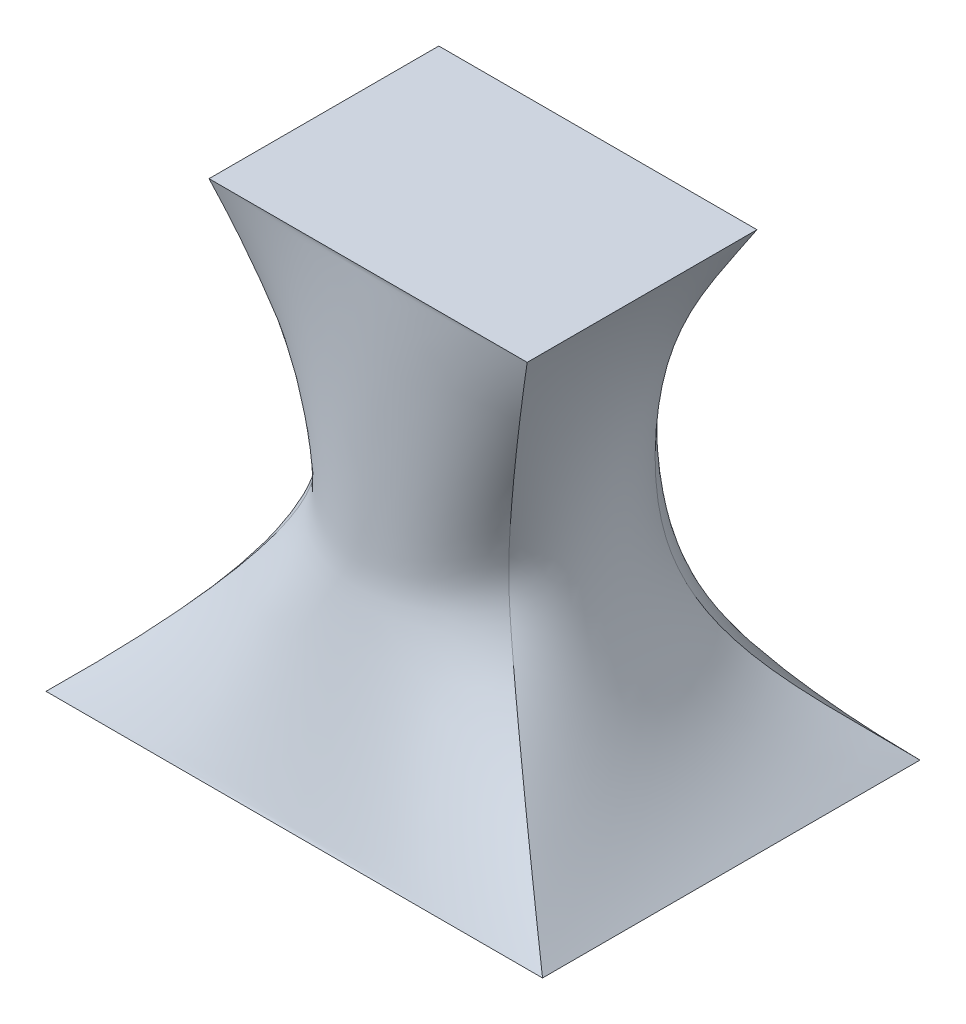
ISO-10303-21;
HEADER;
FILE_DESCRIPTION(('STEP AP214'),'2;1');
FILE_NAME('part.step','',(''),(''),'','','');
FILE_SCHEMA(('AUTOMOTIVE_DESIGN { 1 0 10303 214 1 1 1 1 }'));
ENDSEC;
DATA;
#1=APPLICATION_CONTEXT('core data for automotive mechanical design processes');
#2=APPLICATION_PROTOCOL_DEFINITION('international standard','automotive_design',2000,#1);
#3=PRODUCT_CONTEXT('',#1,'mechanical');
#4=PRODUCT('Part','Part','',(#3));
#5=PRODUCT_RELATED_PRODUCT_CATEGORY('part','',(#4));
#6=PRODUCT_DEFINITION_FORMATION('','',#4);
#7=PRODUCT_DEFINITION_CONTEXT('part definition',#1,'design');
#8=PRODUCT_DEFINITION('design','',#6,#7);
#9=PRODUCT_DEFINITION_SHAPE('','',#8);
#10=(LENGTH_UNIT() NAMED_UNIT(*) SI_UNIT(.MILLI.,.METRE.));
#11=(NAMED_UNIT(*) PLANE_ANGLE_UNIT() SI_UNIT($,.RADIAN.));
#12=(NAMED_UNIT(*) SI_UNIT($,.STERADIAN.) SOLID_ANGLE_UNIT());
#13=UNCERTAINTY_MEASURE_WITH_UNIT(LENGTH_MEASURE(1.E-05),#10,'distance_accuracy_value','');
#14=(GEOMETRIC_REPRESENTATION_CONTEXT(3) GLOBAL_UNCERTAINTY_ASSIGNED_CONTEXT((#13)) GLOBAL_UNIT_ASSIGNED_CONTEXT((#10,
#11,#12)) REPRESENTATION_CONTEXT('',''));
#15=CARTESIAN_POINT('',(0.,0.,0.));
#16=DIRECTION('',(0.,0.,1.));
#17=DIRECTION('',(1.,0.,0.));
#18=AXIS2_PLACEMENT_3D('',#15,#16,#17);
#19=CARTESIAN_POINT('',(0.,89.15,0.));
#20=DIRECTION('',(0.,1.,0.));
#21=DIRECTION('',(0.,0.,1.));
#22=AXIS2_PLACEMENT_3D('',#19,#20,#21);
#23=PLANE('',#22);
#24=DIRECTION('',(0.,0.,-1.));
#25=VECTOR('',#24,1.);
#26=CARTESIAN_POINT('',(31.4,89.15,22.675));
#27=LINE('',#26,#25);
#28=CARTESIAN_POINT('',(31.4,89.15,22.675));
#29=VERTEX_POINT('',#28);
#30=CARTESIAN_POINT('',(31.4,89.15,-22.675));
#31=VERTEX_POINT('',#30);
#32=EDGE_CURVE('E251',#29,#31,#27,.T.);
#33=ORIENTED_EDGE('',*,*,#32,.T.);
#34=DIRECTION('',(-1.,0.,0.));
#35=VECTOR('',#34,1.);
#36=CARTESIAN_POINT('',(31.4,89.15,-22.675));
#37=LINE('',#36,#35);
#38=CARTESIAN_POINT('',(-31.4,89.15,-22.675));
#39=VERTEX_POINT('',#38);
#40=EDGE_CURVE('E307',#31,#39,#37,.T.);
#41=ORIENTED_EDGE('',*,*,#40,.T.);
#42=DIRECTION('',(0.,0.,1.));
#43=VECTOR('',#42,1.);
#44=CARTESIAN_POINT('',(-31.4,89.15,22.675));
#45=LINE('',#44,#43);
#46=CARTESIAN_POINT('',(-31.4,89.15,22.675));
#47=VERTEX_POINT('',#46);
#48=EDGE_CURVE('E106',#39,#47,#45,.T.);
#49=ORIENTED_EDGE('',*,*,#48,.T.);
#50=DIRECTION('',(1.,0.,0.));
#51=VECTOR('',#50,1.);
#52=CARTESIAN_POINT('',(31.4,89.15,22.675));
#53=LINE('',#52,#51);
#54=EDGE_CURVE('E12',#47,#29,#53,.T.);
#55=ORIENTED_EDGE('',*,*,#54,.T.);
#56=EDGE_LOOP('',(#33,#41,#49,#55));
#57=FACE_BOUND('',#56,.T.);
#58=ADVANCED_FACE('F96',(#57),#23,.T.);
#59=CARTESIAN_POINT('',(0.,0.,0.));
#60=DIRECTION('',(0.,1.,0.));
#61=DIRECTION('',(0.,0.,1.));
#62=AXIS2_PLACEMENT_3D('',#59,#60,#61);
#63=PLANE('',#62);
#64=DIRECTION('',(0.,0.,1.));
#65=VECTOR('',#64,1.);
#66=CARTESIAN_POINT('',(-49.,0.,-37.25));
#67=LINE('',#66,#65);
#68=CARTESIAN_POINT('',(-49.,0.,-37.25));
#69=VERTEX_POINT('',#68);
#70=CARTESIAN_POINT('',(-49.,0.,37.25));
#71=VERTEX_POINT('',#70);
#72=EDGE_CURVE('E143',#69,#71,#67,.T.);
#73=ORIENTED_EDGE('',*,*,#72,.F.);
#74=DIRECTION('',(-1.,0.,0.));
#75=VECTOR('',#74,1.);
#76=CARTESIAN_POINT('',(-49.,0.,-37.25));
#77=LINE('',#76,#75);
#78=CARTESIAN_POINT('',(49.,0.,-37.25));
#79=VERTEX_POINT('',#78);
#80=EDGE_CURVE('E151',#79,#69,#77,.T.);
#81=ORIENTED_EDGE('',*,*,#80,.F.);
#82=DIRECTION('',(0.,0.,-1.));
#83=VECTOR('',#82,1.);
#84=CARTESIAN_POINT('',(49.,0.,-37.25));
#85=LINE('',#84,#83);
#86=CARTESIAN_POINT('',(49.,0.,37.25));
#87=VERTEX_POINT('',#86);
#88=EDGE_CURVE('E159',#87,#79,#85,.T.);
#89=ORIENTED_EDGE('',*,*,#88,.F.);
#90=DIRECTION('',(1.,0.,0.));
#91=VECTOR('',#90,1.);
#92=CARTESIAN_POINT('',(-49.,0.,37.25));
#93=LINE('',#92,#91);
#94=EDGE_CURVE('E165',#71,#87,#93,.T.);
#95=ORIENTED_EDGE('',*,*,#94,.F.);
#96=EDGE_LOOP('',(#73,#81,#89,#95));
#97=FACE_BOUND('',#96,.T.);
#98=ADVANCED_FACE('F163',(#97),#63,.F.);
#99=CARTESIAN_POINT('',(49.,0.,37.25));
#100=CARTESIAN_POINT('',(38.3643414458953,10.4842172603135,28.9843410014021));
#101=CARTESIAN_POINT('',(19.980872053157,30.790261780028,14.6483322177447));
#102=CARTESIAN_POINT('',(17.8796515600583,49.2728906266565,13.0862870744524));
#103=CARTESIAN_POINT('',(26.1364088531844,75.4523057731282,18.9126378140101));
#104=CARTESIAN_POINT('',(31.4,89.15,22.675));
#105=CARTESIAN_POINT('',(49.,0.,12.4166666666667));
#106=CARTESIAN_POINT('',(37.9254530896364,10.2209857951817,9.98486193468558));
#107=CARTESIAN_POINT('',(27.8064209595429,27.7093190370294,6.15245308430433));
#108=CARTESIAN_POINT('',(24.1589798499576,55.0908072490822,5.31569892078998));
#109=CARTESIAN_POINT('',(26.1062027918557,76.668098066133,6.34792777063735));
#110=CARTESIAN_POINT('',(31.4,89.15,7.55833333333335));
#111=CARTESIAN_POINT('',(49.,0.,-12.4166666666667));
#112=CARTESIAN_POINT('',(37.4865647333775,9.95775433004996,-9.01461713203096));
#113=CARTESIAN_POINT('',(29.4918333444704,23.5732095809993,-6.8406907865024));
#114=CARTESIAN_POINT('',(21.104223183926,62.8793959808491,-4.32501746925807));
#115=CARTESIAN_POINT('',(26.075996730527,77.8838903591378,-6.21678227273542));
#116=CARTESIAN_POINT('',(31.4,89.15,-7.55833333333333));
#117=CARTESIAN_POINT('',(49.,0.,-37.25));
#118=CARTESIAN_POINT('',(37.0476763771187,9.69452286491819,-28.0140961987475));
#119=CARTESIAN_POINT('',(19.2340280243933,19.9599615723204,-14.2801314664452));
#120=CARTESIAN_POINT('',(19.5606155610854,69.6914674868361,-14.0541533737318));
#121=CARTESIAN_POINT('',(26.0457906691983,79.0996826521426,-18.7814923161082));
#122=CARTESIAN_POINT('',(31.4,89.15,-22.675));
#123=B_SPLINE_SURFACE_WITH_KNOTS('',3,3,((#99,#100,#101,#102,#103,#104),(#105,#106,#107,#108,
#109,#110),(#111,#112,#113,#114,#115,#116),(#117,#118,#119,#120,#121,#122)),.UNSPECIFIED.,.F.,
.F.,.F.,(4,4),(4,1,1,4),(0.,1.),(0.,0.446084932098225,0.618884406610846,1.),.UNSPECIFIED.);
#124=CARTESIAN_POINT('',(49.,0.,-37.25));
#125=CARTESIAN_POINT('',(37.0476763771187,9.69452286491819,-28.0140961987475));
#126=CARTESIAN_POINT('',(19.2340280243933,19.9599615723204,-14.2801314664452));
#127=CARTESIAN_POINT('',(19.5606155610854,69.6914674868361,-14.0541533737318));
#128=CARTESIAN_POINT('',(26.0457906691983,79.0996826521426,-18.7814923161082));
#129=CARTESIAN_POINT('',(31.4,89.15,-22.675));
#130=B_SPLINE_CURVE_WITH_KNOTS('',3,(#124,#125,#126,#127,#128,#129),.UNSPECIFIED.,.F.,.F.,(4,1,
1,4),(0.,0.446084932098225,0.618884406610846,1.),.UNSPECIFIED.);
#131=EDGE_CURVE('E148',#79,#31,#130,.T.);
#132=CARTESIAN_POINT('',(49.,0.,37.25));
#133=CARTESIAN_POINT('',(38.3643414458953,10.4842172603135,28.9843410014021));
#134=CARTESIAN_POINT('',(19.980872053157,30.790261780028,14.6483322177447));
#135=CARTESIAN_POINT('',(17.8796515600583,49.2728906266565,13.0862870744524));
#136=CARTESIAN_POINT('',(26.1364088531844,75.4523057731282,18.9126378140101));
#137=CARTESIAN_POINT('',(31.4,89.15,22.675));
#138=B_SPLINE_CURVE_WITH_KNOTS('',3,(#132,#133,#134,#135,#136,#137),.UNSPECIFIED.,.F.,.F.,(4,1,
1,4),(0.,0.446084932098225,0.618884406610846,1.),.UNSPECIFIED.);
#139=EDGE_CURVE('E158',#29,#87,#138,.F.);
#140=ORIENTED_EDGE('',*,*,#88,.T.);
#141=ORIENTED_EDGE('',*,*,#131,.T.);
#142=ORIENTED_EDGE('',*,*,#32,.F.);
#143=ORIENTED_EDGE('',*,*,#139,.T.);
#144=EDGE_LOOP('',(#140,#141,#142,#143));
#145=FACE_BOUND('',#144,.T.);
#146=ADVANCED_FACE('F186',(#145),#123,.T.);
#147=CARTESIAN_POINT('',(49.,0.,-37.25));
#148=CARTESIAN_POINT('',(37.0476763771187,9.69452286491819,-28.0140961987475));
#149=CARTESIAN_POINT('',(19.2340280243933,19.9599615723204,-14.2801314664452));
#150=CARTESIAN_POINT('',(19.5606155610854,69.6914674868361,-14.0541533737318));
#151=CARTESIAN_POINT('',(26.0457906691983,79.0996826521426,-18.7814923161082));
#152=CARTESIAN_POINT('',(31.4,89.15,-22.675));
#153=CARTESIAN_POINT('',(44.9166666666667,0.,-37.25));
#154=CARTESIAN_POINT('',(33.9973863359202,9.94974006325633,-28.6164420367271));
#155=CARTESIAN_POINT('',(18.2425083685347,19.3659619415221,-16.2853734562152));
#156=CARTESIAN_POINT('',(18.3787618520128,70.7389652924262,-15.2821515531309));
#157=CARTESIAN_POINT('',(23.9981287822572,79.1620843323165,-19.2912351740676));
#158=CARTESIAN_POINT('',(28.7833333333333,89.15,-22.675));
#159=CARTESIAN_POINT('',(38.7916666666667,0.,-37.25));
#160=CARTESIAN_POINT('',(29.4219512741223,10.3325658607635,-29.5199607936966));
#161=CARTESIAN_POINT('',(16.4450735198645,18.5683890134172,-19.0138013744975));
#162=CARTESIAN_POINT('',(16.36100654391,72.1357248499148,-16.8567355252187));
#163=CARTESIAN_POINT('',(20.9266359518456,79.2556868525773,-20.0558494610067));
#164=CARTESIAN_POINT('',(24.8583333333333,89.15,-22.675));
#165=CARTESIAN_POINT('',(30.625,0.,-37.25));
#166=CARTESIAN_POINT('',(23.2872615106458,10.7524857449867,-30.5218699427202));
#167=CARTESIAN_POINT('',(13.5319463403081,17.713452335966,-22.0062444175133));
#168=CARTESIAN_POINT('',(13.317270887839,73.6306254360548,-18.4734216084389));
#169=CARTESIAN_POINT('',(16.6707185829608,79.3879448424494,-20.8534286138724));
#170=CARTESIAN_POINT('',(19.625,89.15,-22.675));
#171=CARTESIAN_POINT('',(24.5,0.,-37.25));
#172=CARTESIAN_POINT('',(18.6748881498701,11.0171577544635,-31.1748168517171));
#173=CARTESIAN_POINT('',(11.1400116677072,17.1779085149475,-23.8961996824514));
#174=CARTESIAN_POINT('',(10.8659587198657,74.5666563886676,-19.4503343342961));
#175=CARTESIAN_POINT('',(13.4246034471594,79.483087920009,-21.3600677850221));
#176=CARTESIAN_POINT('',(15.7,89.15,-22.675));
#177=CARTESIAN_POINT('',(18.375,0.,-37.25));
#178=CARTESIAN_POINT('',(14.040489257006,11.2241368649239,-31.7074696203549));
#179=CARTESIAN_POINT('',(8.55654819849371,16.7500953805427,-25.4117907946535));
#180=CARTESIAN_POINT('',(8.27330490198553,75.315473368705,-20.197967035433));
#181=CARTESIAN_POINT('',(10.1215002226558,79.5688866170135,-21.7595735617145));
#182=CARTESIAN_POINT('',(11.775,89.15,-22.675));
#183=CARTESIAN_POINT('',(10.2083333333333,0.,-37.25));
#184=CARTESIAN_POINT('',(7.84238865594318,11.4210685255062,-32.2372112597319));
#185=CARTESIAN_POINT('',(4.93864860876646,16.3249532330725,-26.8982606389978));
#186=CARTESIAN_POINT('',(4.65890623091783,76.0617380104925,-20.8982233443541));
#187=CARTESIAN_POINT('',(5.65520895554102,79.6626071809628,-22.1451326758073));
#188=CARTESIAN_POINT('',(6.54166666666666,89.15,-22.675));
#189=CARTESIAN_POINT('',(0.,0.,-37.25));
#190=CARTESIAN_POINT('',(4.46467732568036E-05,11.5168800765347,-32.5241254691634));
#191=CARTESIAN_POINT('',(0.0014693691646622,16.068912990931,-27.695386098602));
#192=CARTESIAN_POINT('',(0.000580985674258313,76.5166986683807,-21.2322442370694));
#193=CARTESIAN_POINT('',(5.0944790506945E-05,79.7278190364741,-22.3399707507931));
#194=CARTESIAN_POINT('',(0.,89.1499999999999,-22.675));
#195=CARTESIAN_POINT('',(-10.2083333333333,0.,-37.25));
#196=CARTESIAN_POINT('',(-7.83811909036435,11.420373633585,-32.2331916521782));
#197=CARTESIAN_POINT('',(-4.92972750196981,16.1891972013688,-26.9080507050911));
#198=CARTESIAN_POINT('',(-4.66629334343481,76.315449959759,-20.8828134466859));
#199=CARTESIAN_POINT('',(-5.65666129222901,79.7063109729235,-22.1424608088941));
#200=CARTESIAN_POINT('',(-6.54166666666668,89.15,-22.675));
#201=CARTESIAN_POINT('',(-18.375,0.,-37.25));
#202=CARTESIAN_POINT('',(-14.0294756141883,11.2220355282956,-31.6981727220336));
#203=CARTESIAN_POINT('',(-8.54113122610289,16.5082411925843,-25.4232976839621));
#204=CARTESIAN_POINT('',(-8.29706434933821,75.7676795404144,-20.1817161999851));
#205=CARTESIAN_POINT('',(-10.125675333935,79.6468003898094,-21.7566933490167));
#206=CARTESIAN_POINT('',(-11.775,89.15,-22.675));
#207=CARTESIAN_POINT('',(-24.5,0.,-37.25));
#208=CARTESIAN_POINT('',(-18.6558981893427,11.0132190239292,-31.1601945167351));
#209=CARTESIAN_POINT('',(-11.1155451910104,16.8583226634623,-23.9050919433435));
#210=CARTESIAN_POINT('',(-10.9085114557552,75.1644828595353,-19.441089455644));
#211=CARTESIAN_POINT('',(-13.4318509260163,79.5861329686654,-21.3582180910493));
#212=CARTESIAN_POINT('',(-15.7,89.15,-22.675));
#213=CARTESIAN_POINT('',(-30.625,0.,-37.25));
#214=CARTESIAN_POINT('',(-23.2576972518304,10.7452871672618,-30.5001074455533));
#215=CARTESIAN_POINT('',(-13.4957097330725,17.318611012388,-22.0077133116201));
#216=CARTESIAN_POINT('',(-13.3849868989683,74.3697924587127,-18.4807171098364));
#217=CARTESIAN_POINT('',(-16.6819291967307,79.5154321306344,-20.8541548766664));
#218=CARTESIAN_POINT('',(-19.625,89.15,-22.675));
#219=CARTESIAN_POINT('',(-38.7916666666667,0.,-37.25));
#220=CARTESIAN_POINT('',(-29.3748221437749,10.3189467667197,-29.4861396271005));
#221=CARTESIAN_POINT('',(-16.3886596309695,18.0771554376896,-18.9978683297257));
#222=CARTESIAN_POINT('',(-16.4717806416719,73.056474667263,-16.9001580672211));
#223=CARTESIAN_POINT('',(-20.9442271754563,79.4148700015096,-20.0617278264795));
#224=CARTESIAN_POINT('',(-24.8583333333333,89.15,-22.675));
#225=CARTESIAN_POINT('',(-44.9166666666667,0.,-37.25));
#226=CARTESIAN_POINT('',(-33.9320647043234,9.924356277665,-28.5694050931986));
#227=CARTESIAN_POINT('',(-18.1651473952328,18.8082725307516,-16.2484099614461));
#228=CARTESIAN_POINT('',(-18.5334721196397,71.7866831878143,-15.3690587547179));
#229=CARTESIAN_POINT('',(-24.0223870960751,79.343433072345,-19.3043722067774));
#230=CARTESIAN_POINT('',(-28.7833333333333,89.15,-22.675));
#231=CARTESIAN_POINT('',(-49.,0.,-37.25));
#232=CARTESIAN_POINT('',(-36.9702264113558,9.66129595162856,-27.9582487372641));
#233=CARTESIAN_POINT('',(-19.1395514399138,19.3607753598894,-14.2239363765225));
#234=CARTESIAN_POINT('',(-19.7507778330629,70.8185881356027,-14.1795166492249));
#235=CARTESIAN_POINT('',(-26.0744937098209,79.295808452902,-18.7994684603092));
#236=CARTESIAN_POINT('',(-31.4,89.15,-22.675));
#237=B_SPLINE_SURFACE_WITH_KNOTS('',3,3,((#147,#148,#149,#150,#151,#152),(#153,#154,#155,#156,
#157,#158),(#159,#160,#161,#162,#163,#164),(#165,#166,#167,#168,#169,#170),(#171,#172,#173,#174,
#175,#176),(#177,#178,#179,#180,#181,#182),(#183,#184,#185,#186,#187,#188),(#189,#190,#191,#192,
#193,#194),(#195,#196,#197,#198,#199,#200),(#201,#202,#203,#204,#205,#206),(#207,#208,#209,#210,
#211,#212),(#213,#214,#215,#216,#217,#218),(#219,#220,#221,#222,#223,#224),(#225,#226,#227,#228,
#229,#230),(#231,#232,#233,#234,#235,#236)),.UNSPECIFIED.,.F.,.F.,.F.,(4,1,1,1,1,1,1,1,1,1,1,1,
4),(4,1,1,4),(0.,0.125,0.1875,0.25,0.3125,0.375,0.5,0.625,0.6875,0.75,0.8125,0.875,1.),(0.,
0.446084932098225,0.618884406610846,1.),.UNSPECIFIED.);
#238=CARTESIAN_POINT('',(-49.,0.,-37.25));
#239=CARTESIAN_POINT('',(-36.9702264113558,9.66129595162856,-27.9582487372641));
#240=CARTESIAN_POINT('',(-19.1395514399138,19.3607753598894,-14.2239363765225));
#241=CARTESIAN_POINT('',(-19.7507778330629,70.8185881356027,-14.1795166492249));
#242=CARTESIAN_POINT('',(-26.0744937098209,79.295808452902,-18.7994684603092));
#243=CARTESIAN_POINT('',(-31.4,89.15,-22.675));
#244=B_SPLINE_CURVE_WITH_KNOTS('',3,(#238,#239,#240,#241,#242,#243),.UNSPECIFIED.,.F.,.F.,(4,1,
1,4),(0.,0.446084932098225,0.618884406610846,1.),.UNSPECIFIED.);
#245=EDGE_CURVE('E139',#69,#39,#244,.T.);
#246=ORIENTED_EDGE('',*,*,#80,.T.);
#247=ORIENTED_EDGE('',*,*,#245,.T.);
#248=ORIENTED_EDGE('',*,*,#40,.F.);
#249=ORIENTED_EDGE('',*,*,#131,.F.);
#250=EDGE_LOOP('',(#246,#247,#248,#249));
#251=FACE_BOUND('',#250,.T.);
#252=ADVANCED_FACE('F153',(#251),#237,.T.);
#253=CARTESIAN_POINT('',(-49.,0.,37.25));
#254=CARTESIAN_POINT('',(-38.3014199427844,10.4363000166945,28.9388972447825));
#255=CARTESIAN_POINT('',(-19.9872275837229,30.2433915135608,14.6652914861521));
#256=CARTESIAN_POINT('',(-17.8797371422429,50.30586571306,13.0701155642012));
#257=CARTESIAN_POINT('',(-26.1023363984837,75.6414171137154,18.8832711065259));
#258=CARTESIAN_POINT('',(-31.4,89.15,22.675));
#259=CARTESIAN_POINT('',(-44.9166666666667,0.,37.25));
#260=CARTESIAN_POINT('',(-35.2584970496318,10.6338533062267,29.5488273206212));
#261=CARTESIAN_POINT('',(-18.9043130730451,30.817330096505,16.469658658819));
#262=CARTESIAN_POINT('',(-16.8670122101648,49.1860559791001,14.6778677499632));
#263=CARTESIAN_POINT('',(-24.0961436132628,75.3652186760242,19.4775182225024));
#264=CARTESIAN_POINT('',(-28.7833333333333,89.15,22.675));
#265=CARTESIAN_POINT('',(-38.7916666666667,0.,37.25));
#266=CARTESIAN_POINT('',(-30.6941127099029,10.930183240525,30.4637224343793));
#267=CARTESIAN_POINT('',(-16.9479593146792,31.6086057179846,18.8311796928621));
#268=CARTESIAN_POINT('',(-15.1419911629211,47.6363893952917,16.9437635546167));
#269=CARTESIAN_POINT('',(-21.0868544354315,74.9509210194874,20.3688888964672));
#270=CARTESIAN_POINT('',(-24.8583333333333,89.15,22.675));
#271=CARTESIAN_POINT('',(-30.625,0.,37.25));
#272=CARTESIAN_POINT('',(-24.3976564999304,11.1970160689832,31.3967751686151));
#273=CARTESIAN_POINT('',(-13.8506470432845,32.5153997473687,21.3287405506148));
#274=CARTESIAN_POINT('',(-12.4768755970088,45.8781278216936,19.5110564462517));
#275=CARTESIAN_POINT('',(-16.8557521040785,74.5627538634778,21.3136875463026));
#276=CARTESIAN_POINT('',(-19.625,89.15,22.675));
#277=CARTESIAN_POINT('',(-24.5,0.,37.25));
#278=CARTESIAN_POINT('',(-19.6198190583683,11.3571321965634,31.9883034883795));
#279=CARTESIAN_POINT('',(-11.3374805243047,33.1029619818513,22.8654527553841));
#280=CARTESIAN_POINT('',(-10.2875065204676,44.7419510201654,21.1686305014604));
#281=CARTESIAN_POINT('',(-13.6104549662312,74.3209812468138,21.9194120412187));
#282=CARTESIAN_POINT('',(-15.7,89.15,22.675));
#283=CARTESIAN_POINT('',(-18.375,0.,37.25));
#284=CARTESIAN_POINT('',(-14.7788561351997,11.4747352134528,32.4566140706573));
#285=CARTESIAN_POINT('',(-8.6592359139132,33.5869469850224,24.0729618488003));
#286=CARTESIAN_POINT('',(-7.91632791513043,43.8095269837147,22.511980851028));
#287=CARTESIAN_POINT('',(-10.2879923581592,74.1336186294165,22.4014357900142));
#288=CARTESIAN_POINT('',(-11.775,89.15,22.675));
#289=CARTESIAN_POINT('',(-10.2083333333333,0.,37.25));
#290=CARTESIAN_POINT('',(-8.27254583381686,11.5830674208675,32.9142388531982));
#291=CARTESIAN_POINT('',(-4.96636711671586,34.0767082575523,25.2420583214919));
#292=CARTESIAN_POINT('',(-4.50821512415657,42.8685627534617,23.8268613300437));
#293=CARTESIAN_POINT('',(-5.76051046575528,73.951309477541,22.8674428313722));
#294=CARTESIAN_POINT('',(-6.54166666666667,89.15,22.675));
#295=CARTESIAN_POINT('',(0.,0.,37.25));
#296=CARTESIAN_POINT('',(-0.000103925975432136,11.6308635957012,33.15731199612));
#297=CARTESIAN_POINT('',(0.00325960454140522,34.379598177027,25.8470123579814));
#298=CARTESIAN_POINT('',(-0.00227807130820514,42.2912846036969,24.5320204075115));
#299=CARTESIAN_POINT('',(-0.00108637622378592,73.8449710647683,23.1119366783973));
#300=CARTESIAN_POINT('',(0.,89.1499999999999,22.675));
#301=CARTESIAN_POINT('',(10.2083333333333,0.,37.25));
#302=CARTESIAN_POINT('',(8.27601212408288,11.5845703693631,32.9197232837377));
#303=CARTESIAN_POINT('',(4.96599142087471,34.2199374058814,25.2221275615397));
#304=CARTESIAN_POINT('',(4.51166564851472,42.6006977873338,23.8618760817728));
#305=CARTESIAN_POINT('',(5.76253227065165,73.9054152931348,22.8769374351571));
#306=CARTESIAN_POINT('',(6.54166666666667,89.15,22.675));
#307=CARTESIAN_POINT('',(18.375,0.,37.25));
#308=CARTESIAN_POINT('',(14.7914876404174,11.4801309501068,32.4680139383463));
#309=CARTESIAN_POINT('',(8.65371828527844,33.8369959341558,24.0403024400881));
#310=CARTESIAN_POINT('',(7.92913487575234,43.3412171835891,22.5683274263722));
#311=CARTESIAN_POINT('',(10.2968064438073,74.0527141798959,22.4186902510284));
#312=CARTESIAN_POINT('',(11.775,89.15,22.675));
#313=CARTESIAN_POINT('',(24.5,0.,37.25));
#314=CARTESIAN_POINT('',(19.63997386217,11.3667096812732,32.0042296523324));
#315=CARTESIAN_POINT('',(11.3258688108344,33.4275763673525,22.8261643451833));
#316=CARTESIAN_POINT('',(10.3091748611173,44.1333658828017,21.2355870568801));
#317=CARTESIAN_POINT('',(13.6254449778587,74.2156358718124,21.9415830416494));
#318=CARTESIAN_POINT('',(15.7,89.15,22.675));
#319=CARTESIAN_POINT('',(30.625,0.,37.25));
#320=CARTESIAN_POINT('',(24.4296057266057,11.2142088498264,31.4209975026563));
#321=CARTESIAN_POINT('',(13.8344940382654,32.9076917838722,21.2859134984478));
#322=CARTESIAN_POINT('',(12.5039612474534,45.141298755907,19.5821400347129));
#323=CARTESIAN_POINT('',(16.8795544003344,74.4323263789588,21.3424178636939));
#324=CARTESIAN_POINT('',(19.625,89.15,22.675));
#325=CARTESIAN_POINT('',(36.75,0.,37.25));
#326=CARTESIAN_POINT('',(29.154703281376,11.0183027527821,30.7194686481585));
#327=CARTESIAN_POINT('',(16.1552739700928,32.2891897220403,19.4157465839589));
#328=CARTESIAN_POINT('',(14.5060992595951,46.3439376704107,17.6506912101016));
#329=CARTESIAN_POINT('',(20.0522001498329,74.707431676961,20.6307776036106));
#330=CARTESIAN_POINT('',(23.55,89.15,22.675));
#331=CARTESIAN_POINT('',(42.875,0.,37.25));
#332=CARTESIAN_POINT('',(33.8113719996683,10.7805472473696,29.9165155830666));
#333=CARTESIAN_POINT('',(18.2345862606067,31.5823612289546,17.2215162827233));
#334=CARTESIAN_POINT('',(16.3107957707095,47.7216854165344,15.4797404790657));
#335=CARTESIAN_POINT('',(23.1484756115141,75.0383997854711,19.8242096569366));
#336=CARTESIAN_POINT('',(27.475,89.15,22.675));
#337=CARTESIAN_POINT('',(46.9583333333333,0.,37.25));
#338=CARTESIAN_POINT('',(36.8466849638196,10.5829939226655,29.2950658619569));
#339=CARTESIAN_POINT('',(19.4347301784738,31.0631404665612,15.5434072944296));
#340=CARTESIAN_POINT('',(17.3812939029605,48.7393019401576,13.9021739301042));
#341=CARTESIAN_POINT('',(25.140431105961,75.3143371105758,19.2164950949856));
#342=CARTESIAN_POINT('',(30.0916666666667,89.15,22.675));
#343=CARTESIAN_POINT('',(49.,0.,37.25));
#344=CARTESIAN_POINT('',(38.3643414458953,10.4842172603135,28.9843410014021));
#345=CARTESIAN_POINT('',(19.980872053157,30.790261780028,14.6483322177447));
#346=CARTESIAN_POINT('',(17.8796515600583,49.2728906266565,13.0862870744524));
#347=CARTESIAN_POINT('',(26.1364088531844,75.4523057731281,18.9126378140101));
#348=CARTESIAN_POINT('',(31.4,89.15,22.675));
#349=B_SPLINE_SURFACE_WITH_KNOTS('',3,3,((#253,#254,#255,#256,#257,#258),(#259,#260,#261,#262,
#263,#264),(#265,#266,#267,#268,#269,#270),(#271,#272,#273,#274,#275,#276),(#277,#278,#279,#280,
#281,#282),(#283,#284,#285,#286,#287,#288),(#289,#290,#291,#292,#293,#294),(#295,#296,#297,#298,
#299,#300),(#301,#302,#303,#304,#305,#306),(#307,#308,#309,#310,#311,#312),(#313,#314,#315,#316,
#317,#318),(#319,#320,#321,#322,#323,#324),(#325,#326,#327,#328,#329,#330),(#331,#332,#333,#334,
#335,#336),(#337,#338,#339,#340,#341,#342),(#343,#344,#345,#346,#347,#348)),.UNSPECIFIED.,.F.,
.F.,.F.,(4,1,1,1,1,1,1,1,1,1,1,1,1,4),(4,1,1,4),(0.,0.125,0.1875,0.25,0.3125,0.375,0.5,0.625,
0.6875,0.75,0.8125,0.875,0.9375,1.),(0.,0.446084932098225,0.618884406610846,1.),.UNSPECIFIED.);
#350=CARTESIAN_POINT('',(-49.,0.,37.25));
#351=CARTESIAN_POINT('',(-38.3014199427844,10.4363000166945,28.9388972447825));
#352=CARTESIAN_POINT('',(-19.9872275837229,30.2433915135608,14.6652914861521));
#353=CARTESIAN_POINT('',(-17.8797371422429,50.30586571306,13.0701155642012));
#354=CARTESIAN_POINT('',(-26.1023363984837,75.6414171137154,18.8832711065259));
#355=CARTESIAN_POINT('',(-31.4,89.15,22.675));
#356=B_SPLINE_CURVE_WITH_KNOTS('',3,(#350,#351,#352,#353,#354,#355),.UNSPECIFIED.,.F.,.F.,(4,1,
1,4),(0.,0.446084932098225,0.618884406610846,1.),.UNSPECIFIED.);
#357=EDGE_CURVE('E114',#71,#47,#356,.T.);
#358=ORIENTED_EDGE('',*,*,#94,.T.);
#359=ORIENTED_EDGE('',*,*,#139,.F.);
#360=ORIENTED_EDGE('',*,*,#54,.F.);
#361=ORIENTED_EDGE('',*,*,#357,.F.);
#362=EDGE_LOOP('',(#358,#359,#360,#361));
#363=FACE_BOUND('',#362,.T.);
#364=ADVANCED_FACE('F230',(#363),#349,.T.);
#365=CARTESIAN_POINT('',(-49.,0.,-37.25));
#366=CARTESIAN_POINT('',(-36.9702264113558,9.66129595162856,-27.9582487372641));
#367=CARTESIAN_POINT('',(-19.1395514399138,19.3607753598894,-14.2239363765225));
#368=CARTESIAN_POINT('',(-19.7507778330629,70.8185881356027,-14.1795166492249));
#369=CARTESIAN_POINT('',(-26.0744937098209,79.295808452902,-18.7994684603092));
#370=CARTESIAN_POINT('',(-31.4,89.15,-22.675));
#371=CARTESIAN_POINT('',(-49.,0.,-12.4166666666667));
#372=CARTESIAN_POINT('',(-37.4139575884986,9.91963063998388,-8.99253340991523));
#373=CARTESIAN_POINT('',(-29.5405965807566,22.8983710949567,-6.86194848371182));
#374=CARTESIAN_POINT('',(-21.0317844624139,64.1489951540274,-4.29557357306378));
#375=CARTESIAN_POINT('',(-26.0837746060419,78.0776780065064,-6.2385552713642));
#376=CARTESIAN_POINT('',(-31.4,89.15,-7.55833333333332));
#377=CARTESIAN_POINT('',(-49.,0.,12.4166666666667));
#378=CARTESIAN_POINT('',(-37.8576887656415,10.1779653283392,9.97318191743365));
#379=CARTESIAN_POINT('',(-27.8661873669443,26.9877824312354,6.14745526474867));
#380=CARTESIAN_POINT('',(-24.0655329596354,56.4488089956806,5.3296074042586));
#381=CARTESIAN_POINT('',(-26.0930555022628,76.8595475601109,6.32235791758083));
#382=CARTESIAN_POINT('',(-31.4,89.15,7.55833333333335));
#383=CARTESIAN_POINT('',(-49.,0.,37.25));
#384=CARTESIAN_POINT('',(-38.3014199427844,10.4363000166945,28.9388972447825));
#385=CARTESIAN_POINT('',(-19.9872275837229,30.2433915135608,14.6652914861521));
#386=CARTESIAN_POINT('',(-17.8797371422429,50.30586571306,13.0701155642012));
#387=CARTESIAN_POINT('',(-26.1023363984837,75.6414171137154,18.8832711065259));
#388=CARTESIAN_POINT('',(-31.4,89.15,22.675));
#389=B_SPLINE_SURFACE_WITH_KNOTS('',3,3,((#365,#366,#367,#368,#369,#370),(#371,#372,#373,#374,
#375,#376),(#377,#378,#379,#380,#381,#382),(#383,#384,#385,#386,#387,#388)),.UNSPECIFIED.,.F.,
.F.,.F.,(4,4),(4,1,1,4),(0.,1.),(0.,0.446084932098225,0.618884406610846,1.),.UNSPECIFIED.);
#390=ORIENTED_EDGE('',*,*,#72,.T.);
#391=ORIENTED_EDGE('',*,*,#357,.T.);
#392=ORIENTED_EDGE('',*,*,#48,.F.);
#393=ORIENTED_EDGE('',*,*,#245,.F.);
#394=EDGE_LOOP('',(#390,#391,#392,#393));
#395=FACE_BOUND('',#394,.T.);
#396=ADVANCED_FACE('F141',(#395),#389,.T.);
#397=CLOSED_SHELL('',(#58,#98,#146,#252,#364,#396));
#398=MANIFOLD_SOLID_BREP('B2',#397);
#399=ADVANCED_BREP_SHAPE_REPRESENTATION('',(#18,#398),#14);
#400=SHAPE_DEFINITION_REPRESENTATION(#9,#399);
ENDSEC;
END-ISO-10303-21;
